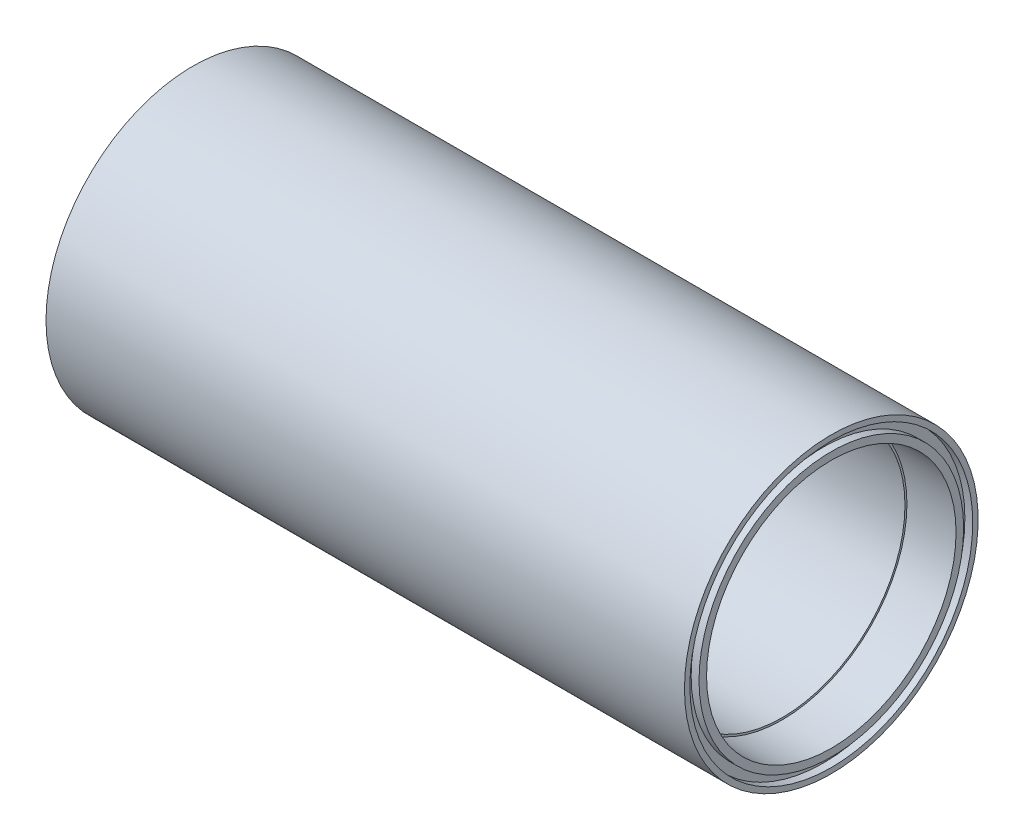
ISO-10303-21;
HEADER;
FILE_DESCRIPTION(('STEP AP214'),'2;1');
FILE_NAME('part.step','',(''),(''),'','','');
FILE_SCHEMA(('AUTOMOTIVE_DESIGN { 1 0 10303 214 1 1 1 1 }'));
ENDSEC;
DATA;
#1=APPLICATION_CONTEXT('core data for automotive mechanical design processes');
#2=APPLICATION_PROTOCOL_DEFINITION('international standard','automotive_design',2000,#1);
#3=PRODUCT_CONTEXT('',#1,'mechanical');
#4=PRODUCT('Part','Part','',(#3));
#5=PRODUCT_RELATED_PRODUCT_CATEGORY('part','',(#4));
#6=PRODUCT_DEFINITION_FORMATION('','',#4);
#7=PRODUCT_DEFINITION_CONTEXT('part definition',#1,'design');
#8=PRODUCT_DEFINITION('design','',#6,#7);
#9=PRODUCT_DEFINITION_SHAPE('','',#8);
#10=(LENGTH_UNIT() NAMED_UNIT(*) SI_UNIT(.MILLI.,.METRE.));
#11=(NAMED_UNIT(*) PLANE_ANGLE_UNIT() SI_UNIT($,.RADIAN.));
#12=(NAMED_UNIT(*) SI_UNIT($,.STERADIAN.) SOLID_ANGLE_UNIT());
#13=UNCERTAINTY_MEASURE_WITH_UNIT(LENGTH_MEASURE(1.E-05),#10,'distance_accuracy_value','');
#14=(GEOMETRIC_REPRESENTATION_CONTEXT(3) GLOBAL_UNCERTAINTY_ASSIGNED_CONTEXT((#13)) GLOBAL_UNIT_ASSIGNED_CONTEXT((#10,
#11,#12)) REPRESENTATION_CONTEXT('',''));
#15=CARTESIAN_POINT('',(0.,0.,0.));
#16=DIRECTION('',(0.,0.,1.));
#17=DIRECTION('',(1.,0.,0.));
#18=AXIS2_PLACEMENT_3D('',#15,#16,#17);
#19=CARTESIAN_POINT('',(82.55,32.258,0.));
#20=DIRECTION('',(-1.,0.,0.));
#21=DIRECTION('',(0.,0.,1.));
#22=AXIS2_PLACEMENT_3D('',#19,#20,#21);
#23=PLANE('',#22);
#24=CARTESIAN_POINT('',(82.55,0.,0.));
#25=DIRECTION('',(-1.,0.,0.));
#26=DIRECTION('',(0.,0.,1.));
#27=AXIS2_PLACEMENT_3D('',#24,#25,#26);
#28=CIRCLE('',#27,32.258);
#29=CARTESIAN_POINT('',(82.55,0.,32.258));
#30=VERTEX_POINT('',#29);
#31=EDGE_CURVE('E61',#30,#30,#28,.T.);
#32=ORIENTED_EDGE('',*,*,#31,.T.);
#33=EDGE_LOOP('',(#32));
#34=FACE_BOUND('',#33,.T.);
#35=CARTESIAN_POINT('',(82.55,0.,0.));
#36=DIRECTION('',(-1.,0.,0.));
#37=DIRECTION('',(0.,0.,1.));
#38=AXIS2_PLACEMENT_3D('',#35,#36,#37);
#39=CIRCLE('',#38,34.2138);
#40=CARTESIAN_POINT('',(82.55,0.,34.2138));
#41=VERTEX_POINT('',#40);
#42=EDGE_CURVE('E97',#41,#41,#39,.T.);
#43=ORIENTED_EDGE('',*,*,#42,.F.);
#44=EDGE_LOOP('',(#43));
#45=FACE_BOUND('',#44,.T.);
#46=ADVANCED_FACE('F46',(#34,#45),#23,.F.);
#47=CARTESIAN_POINT('',(-82.55,37.973,0.));
#48=DIRECTION('',(1.,0.,0.));
#49=DIRECTION('',(0.,0.,-1.));
#50=AXIS2_PLACEMENT_3D('',#47,#48,#49);
#51=PLANE('',#50);
#52=CARTESIAN_POINT('',(-82.55,0.,0.));
#53=DIRECTION('',(-1.,0.,0.));
#54=DIRECTION('',(0.,0.,1.));
#55=AXIS2_PLACEMENT_3D('',#52,#53,#54);
#56=CIRCLE('',#55,32.258);
#57=CARTESIAN_POINT('',(-82.55,0.,32.258));
#58=VERTEX_POINT('',#57);
#59=EDGE_CURVE('E12',#58,#58,#56,.T.);
#60=ORIENTED_EDGE('',*,*,#59,.F.);
#61=EDGE_LOOP('',(#60));
#62=FACE_BOUND('',#61,.T.);
#63=CARTESIAN_POINT('',(-82.55,0.,0.));
#64=DIRECTION('',(-1.,0.,0.));
#65=DIRECTION('',(0.,0.,1.));
#66=AXIS2_PLACEMENT_3D('',#63,#64,#65);
#67=CIRCLE('',#66,34.2138);
#68=CARTESIAN_POINT('',(-82.55,0.,34.2138));
#69=VERTEX_POINT('',#68);
#70=EDGE_CURVE('E85',#69,#69,#67,.T.);
#71=ORIENTED_EDGE('',*,*,#70,.T.);
#72=EDGE_LOOP('',(#71));
#73=FACE_BOUND('',#72,.T.);
#74=ADVANCED_FACE('F113',(#62,#73),#51,.F.);
#75=CARTESIAN_POINT('',(0.,0.,0.));
#76=DIRECTION('',(-1.,0.,0.));
#77=DIRECTION('',(0.,0.,1.));
#78=AXIS2_PLACEMENT_3D('',#75,#76,#77);
#79=CYLINDRICAL_SURFACE('',#78,32.258);
#80=CARTESIAN_POINT('',(-69.85,0.,0.));
#81=DIRECTION('',(-1.,0.,0.));
#82=DIRECTION('',(0.,0.,1.));
#83=AXIS2_PLACEMENT_3D('',#80,#81,#82);
#84=CIRCLE('',#83,32.258);
#85=CARTESIAN_POINT('',(-69.85,0.,32.258));
#86=VERTEX_POINT('',#85);
#87=EDGE_CURVE('E75',#86,#86,#84,.T.);
#88=ORIENTED_EDGE('',*,*,#87,.F.);
#89=EDGE_LOOP('',(#88));
#90=FACE_BOUND('',#89,.T.);
#91=ORIENTED_EDGE('',*,*,#59,.T.);
#92=EDGE_LOOP('',(#91));
#93=FACE_BOUND('',#92,.T.);
#94=ADVANCED_FACE('F48',(#90,#93),#79,.F.);
#95=CARTESIAN_POINT('',(-82.55,0.,0.));
#96=DIRECTION('',(-1.,0.,0.));
#97=DIRECTION('',(0.,0.,1.));
#98=AXIS2_PLACEMENT_3D('',#95,#96,#97);
#99=CIRCLE('',#98,36.576);
#100=CARTESIAN_POINT('',(-82.55,0.,36.576));
#101=VERTEX_POINT('',#100);
#102=EDGE_CURVE('E79',#101,#101,#99,.T.);
#103=ORIENTED_EDGE('',*,*,#102,.F.);
#104=EDGE_LOOP('',(#103));
#105=FACE_BOUND('',#104,.T.);
#106=CARTESIAN_POINT('',(-82.55,0.,0.));
#107=DIRECTION('',(-1.,0.,0.));
#108=DIRECTION('',(0.,0.,1.));
#109=AXIS2_PLACEMENT_3D('',#106,#107,#108);
#110=CIRCLE('',#109,37.973);
#111=CARTESIAN_POINT('',(-82.55,0.,37.973));
#112=VERTEX_POINT('',#111);
#113=EDGE_CURVE('E53',#112,#112,#110,.T.);
#114=ORIENTED_EDGE('',*,*,#113,.T.);
#115=EDGE_LOOP('',(#114));
#116=FACE_BOUND('',#115,.T.);
#117=ADVANCED_FACE('F121',(#105,#116),#51,.F.);
#118=CARTESIAN_POINT('',(0.,0.,0.));
#119=DIRECTION('',(-1.,0.,0.));
#120=DIRECTION('',(0.,0.,1.));
#121=AXIS2_PLACEMENT_3D('',#118,#119,#120);
#122=CYLINDRICAL_SURFACE('',#121,37.973);
#123=ORIENTED_EDGE('',*,*,#113,.F.);
#124=EDGE_LOOP('',(#123));
#125=FACE_BOUND('',#124,.T.);
#126=CARTESIAN_POINT('',(82.55,0.,0.));
#127=DIRECTION('',(-1.,0.,0.));
#128=DIRECTION('',(0.,0.,1.));
#129=AXIS2_PLACEMENT_3D('',#126,#127,#128);
#130=CIRCLE('',#129,37.973);
#131=CARTESIAN_POINT('',(82.55,0.,37.973));
#132=VERTEX_POINT('',#131);
#133=EDGE_CURVE('E57',#132,#132,#130,.T.);
#134=ORIENTED_EDGE('',*,*,#133,.T.);
#135=EDGE_LOOP('',(#134));
#136=FACE_BOUND('',#135,.T.);
#137=ADVANCED_FACE('F126',(#125,#136),#122,.T.);
#138=CARTESIAN_POINT('',(82.55,0.,0.));
#139=DIRECTION('',(-1.,0.,0.));
#140=DIRECTION('',(0.,0.,1.));
#141=AXIS2_PLACEMENT_3D('',#138,#139,#140);
#142=CIRCLE('',#141,36.576);
#143=CARTESIAN_POINT('',(82.55,0.,36.576));
#144=VERTEX_POINT('',#143);
#145=EDGE_CURVE('E91',#144,#144,#142,.T.);
#146=ORIENTED_EDGE('',*,*,#145,.T.);
#147=EDGE_LOOP('',(#146));
#148=FACE_BOUND('',#147,.T.);
#149=ORIENTED_EDGE('',*,*,#133,.F.);
#150=EDGE_LOOP('',(#149));
#151=FACE_BOUND('',#150,.T.);
#152=ADVANCED_FACE('F116',(#148,#151),#23,.F.);
#153=CARTESIAN_POINT('',(0.,0.,0.));
#154=DIRECTION('',(-1.,0.,0.));
#155=DIRECTION('',(0.,0.,1.));
#156=AXIS2_PLACEMENT_3D('',#153,#154,#155);
#157=CYLINDRICAL_SURFACE('',#156,32.258);
#158=ORIENTED_EDGE('',*,*,#31,.F.);
#159=EDGE_LOOP('',(#158));
#160=FACE_BOUND('',#159,.T.);
#161=CARTESIAN_POINT('',(69.85,0.,0.));
#162=DIRECTION('',(-1.,0.,0.));
#163=DIRECTION('',(0.,0.,1.));
#164=AXIS2_PLACEMENT_3D('',#161,#162,#163);
#165=CIRCLE('',#164,32.258);
#166=CARTESIAN_POINT('',(69.85,0.,32.258));
#167=VERTEX_POINT('',#166);
#168=EDGE_CURVE('E66',#167,#167,#165,.T.);
#169=ORIENTED_EDGE('',*,*,#168,.T.);
#170=EDGE_LOOP('',(#169));
#171=FACE_BOUND('',#170,.T.);
#172=ADVANCED_FACE('F125',(#160,#171),#157,.F.);
#173=CARTESIAN_POINT('',(69.85,31.75,0.));
#174=DIRECTION('',(-1.,0.,0.));
#175=DIRECTION('',(0.,0.,1.));
#176=AXIS2_PLACEMENT_3D('',#173,#174,#175);
#177=PLANE('',#176);
#178=ORIENTED_EDGE('',*,*,#168,.F.);
#179=EDGE_LOOP('',(#178));
#180=FACE_BOUND('',#179,.T.);
#181=CARTESIAN_POINT('',(69.85,0.,0.));
#182=DIRECTION('',(-1.,0.,0.));
#183=DIRECTION('',(0.,0.,1.));
#184=AXIS2_PLACEMENT_3D('',#181,#182,#183);
#185=CIRCLE('',#184,31.75);
#186=CARTESIAN_POINT('',(69.85,0.,31.75));
#187=VERTEX_POINT('',#186);
#188=EDGE_CURVE('E69',#187,#187,#185,.T.);
#189=ORIENTED_EDGE('',*,*,#188,.T.);
#190=EDGE_LOOP('',(#189));
#191=FACE_BOUND('',#190,.T.);
#192=ADVANCED_FACE('F132',(#180,#191),#177,.F.);
#193=CARTESIAN_POINT('',(0.,0.,0.));
#194=DIRECTION('',(-1.,0.,0.));
#195=DIRECTION('',(0.,0.,1.));
#196=AXIS2_PLACEMENT_3D('',#193,#194,#195);
#197=CYLINDRICAL_SURFACE('',#196,31.75);
#198=ORIENTED_EDGE('',*,*,#188,.F.);
#199=EDGE_LOOP('',(#198));
#200=FACE_BOUND('',#199,.T.);
#201=CARTESIAN_POINT('',(-69.85,0.,0.));
#202=DIRECTION('',(-1.,0.,0.));
#203=DIRECTION('',(0.,0.,1.));
#204=AXIS2_PLACEMENT_3D('',#201,#202,#203);
#205=CIRCLE('',#204,31.75);
#206=CARTESIAN_POINT('',(-69.85,0.,31.75));
#207=VERTEX_POINT('',#206);
#208=EDGE_CURVE('E72',#207,#207,#205,.T.);
#209=ORIENTED_EDGE('',*,*,#208,.T.);
#210=EDGE_LOOP('',(#209));
#211=FACE_BOUND('',#210,.T.);
#212=ADVANCED_FACE('F164',(#200,#211),#197,.F.);
#213=CARTESIAN_POINT('',(-69.85,32.258,0.));
#214=DIRECTION('',(1.,0.,0.));
#215=DIRECTION('',(0.,0.,-1.));
#216=AXIS2_PLACEMENT_3D('',#213,#214,#215);
#217=PLANE('',#216);
#218=ORIENTED_EDGE('',*,*,#208,.F.);
#219=EDGE_LOOP('',(#218));
#220=FACE_BOUND('',#219,.T.);
#221=ORIENTED_EDGE('',*,*,#87,.T.);
#222=EDGE_LOOP('',(#221));
#223=FACE_BOUND('',#222,.T.);
#224=ADVANCED_FACE('F160',(#220,#223),#217,.F.);
#225=CARTESIAN_POINT('',(-80.518,0.,0.));
#226=DIRECTION('',(-1.,0.,0.));
#227=DIRECTION('',(0.,0.,1.));
#228=AXIS2_PLACEMENT_3D('',#225,#226,#227);
#229=CYLINDRICAL_SURFACE('',#228,36.576);
#230=CARTESIAN_POINT('',(-80.518,0.,0.));
#231=DIRECTION('',(-1.,0.,0.));
#232=DIRECTION('',(0.,0.,1.));
#233=AXIS2_PLACEMENT_3D('',#230,#231,#232);
#234=CIRCLE('',#233,36.576);
#235=CARTESIAN_POINT('',(-80.518,0.,36.576));
#236=VERTEX_POINT('',#235);
#237=EDGE_CURVE('E78',#236,#236,#234,.T.);
#238=ORIENTED_EDGE('',*,*,#237,.F.);
#239=EDGE_LOOP('',(#238));
#240=FACE_BOUND('',#239,.T.);
#241=ORIENTED_EDGE('',*,*,#102,.T.);
#242=EDGE_LOOP('',(#241));
#243=FACE_BOUND('',#242,.T.);
#244=ADVANCED_FACE('F156',(#240,#243),#229,.F.);
#245=CARTESIAN_POINT('',(-80.518,0.,0.));
#246=DIRECTION('',(-1.,0.,0.));
#247=DIRECTION('',(0.,0.,1.));
#248=AXIS2_PLACEMENT_3D('',#245,#246,#247);
#249=PLANE('',#248);
#250=CARTESIAN_POINT('',(-80.518,0.,0.));
#251=DIRECTION('',(-1.,0.,0.));
#252=DIRECTION('',(0.,0.,1.));
#253=AXIS2_PLACEMENT_3D('',#250,#251,#252);
#254=CIRCLE('',#253,34.2138);
#255=CARTESIAN_POINT('',(-80.518,0.,34.2138));
#256=VERTEX_POINT('',#255);
#257=EDGE_CURVE('E82',#256,#256,#254,.T.);
#258=ORIENTED_EDGE('',*,*,#257,.F.);
#259=EDGE_LOOP('',(#258));
#260=FACE_BOUND('',#259,.T.);
#261=ORIENTED_EDGE('',*,*,#237,.T.);
#262=EDGE_LOOP('',(#261));
#263=FACE_BOUND('',#262,.T.);
#264=ADVANCED_FACE('F152',(#260,#263),#249,.T.);
#265=CARTESIAN_POINT('',(-80.518,0.,0.));
#266=DIRECTION('',(-1.,0.,0.));
#267=DIRECTION('',(0.,0.,1.));
#268=AXIS2_PLACEMENT_3D('',#265,#266,#267);
#269=CYLINDRICAL_SURFACE('',#268,34.2138);
#270=ORIENTED_EDGE('',*,*,#257,.T.);
#271=EDGE_LOOP('',(#270));
#272=FACE_BOUND('',#271,.T.);
#273=ORIENTED_EDGE('',*,*,#70,.F.);
#274=EDGE_LOOP('',(#273));
#275=FACE_BOUND('',#274,.T.);
#276=ADVANCED_FACE('F146',(#272,#275),#269,.T.);
#277=CARTESIAN_POINT('',(80.518,0.,0.));
#278=DIRECTION('',(1.,0.,0.));
#279=DIRECTION('',(0.,0.,1.));
#280=AXIS2_PLACEMENT_3D('',#277,#278,#279);
#281=PLANE('',#280);
#282=CARTESIAN_POINT('',(80.518,0.,0.));
#283=DIRECTION('',(-1.,0.,0.));
#284=DIRECTION('',(0.,0.,1.));
#285=AXIS2_PLACEMENT_3D('',#282,#283,#284);
#286=CIRCLE('',#285,36.576);
#287=CARTESIAN_POINT('',(80.518,0.,36.576));
#288=VERTEX_POINT('',#287);
#289=EDGE_CURVE('E88',#288,#288,#286,.T.);
#290=ORIENTED_EDGE('',*,*,#289,.F.);
#291=EDGE_LOOP('',(#290));
#292=FACE_BOUND('',#291,.T.);
#293=CARTESIAN_POINT('',(80.518,0.,0.));
#294=DIRECTION('',(-1.,0.,0.));
#295=DIRECTION('',(0.,0.,1.));
#296=AXIS2_PLACEMENT_3D('',#293,#294,#295);
#297=CIRCLE('',#296,34.2138);
#298=CARTESIAN_POINT('',(80.518,0.,34.2138));
#299=VERTEX_POINT('',#298);
#300=EDGE_CURVE('E94',#299,#299,#297,.T.);
#301=ORIENTED_EDGE('',*,*,#300,.T.);
#302=EDGE_LOOP('',(#301));
#303=FACE_BOUND('',#302,.T.);
#304=ADVANCED_FACE('F103',(#292,#303),#281,.T.);
#305=CARTESIAN_POINT('',(80.518,0.,0.));
#306=DIRECTION('',(1.,0.,0.));
#307=DIRECTION('',(0.,0.,-1.));
#308=AXIS2_PLACEMENT_3D('',#305,#306,#307);
#309=CYLINDRICAL_SURFACE('',#308,36.576);
#310=ORIENTED_EDGE('',*,*,#289,.T.);
#311=EDGE_LOOP('',(#310));
#312=FACE_BOUND('',#311,.T.);
#313=ORIENTED_EDGE('',*,*,#145,.F.);
#314=EDGE_LOOP('',(#313));
#315=FACE_BOUND('',#314,.T.);
#316=ADVANCED_FACE('F108',(#312,#315),#309,.F.);
#317=CARTESIAN_POINT('',(80.518,0.,0.));
#318=DIRECTION('',(1.,0.,0.));
#319=DIRECTION('',(0.,0.,-1.));
#320=AXIS2_PLACEMENT_3D('',#317,#318,#319);
#321=CYLINDRICAL_SURFACE('',#320,34.2138);
#322=ORIENTED_EDGE('',*,*,#300,.F.);
#323=EDGE_LOOP('',(#322));
#324=FACE_BOUND('',#323,.T.);
#325=ORIENTED_EDGE('',*,*,#42,.T.);
#326=EDGE_LOOP('',(#325));
#327=FACE_BOUND('',#326,.T.);
#328=ADVANCED_FACE('F105',(#324,#327),#321,.T.);
#329=CLOSED_SHELL('',(#46,#74,#94,#117,#137,#152,#172,#192,#212,#224,#244,#264,#276,#304,#316,#328));
#330=MANIFOLD_SOLID_BREP('B2',#329);
#331=ADVANCED_BREP_SHAPE_REPRESENTATION('',(#18,#330),#14);
#332=SHAPE_DEFINITION_REPRESENTATION(#9,#331);
ENDSEC;
END-ISO-10303-21;
